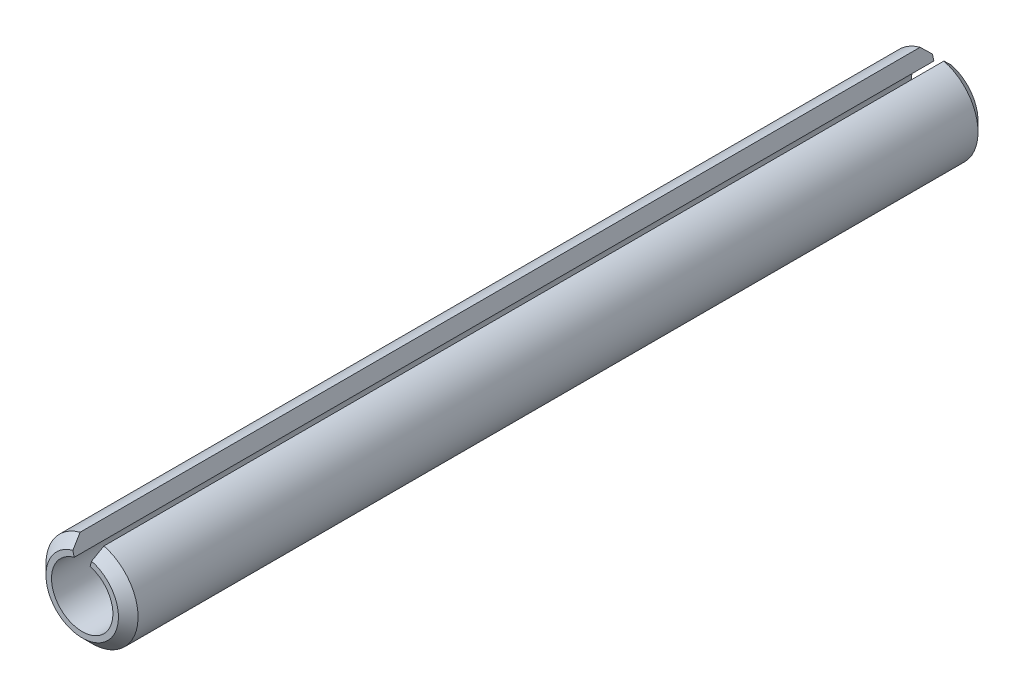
ISO-10303-21;
HEADER;
FILE_DESCRIPTION(('STEP AP214'),'2;1');
FILE_NAME('part.step','',(''),(''),'','','');
FILE_SCHEMA(('AUTOMOTIVE_DESIGN { 1 0 10303 214 1 1 1 1 }'));
ENDSEC;
DATA;
#1=APPLICATION_CONTEXT('core data for automotive mechanical design processes');
#2=APPLICATION_PROTOCOL_DEFINITION('international standard','automotive_design',2000,#1);
#3=PRODUCT_CONTEXT('',#1,'mechanical');
#4=PRODUCT('Part','Part','',(#3));
#5=PRODUCT_RELATED_PRODUCT_CATEGORY('part','',(#4));
#6=PRODUCT_DEFINITION_FORMATION('','',#4);
#7=PRODUCT_DEFINITION_CONTEXT('part definition',#1,'design');
#8=PRODUCT_DEFINITION('design','',#6,#7);
#9=PRODUCT_DEFINITION_SHAPE('','',#8);
#10=(LENGTH_UNIT() NAMED_UNIT(*) SI_UNIT(.MILLI.,.METRE.));
#11=(NAMED_UNIT(*) PLANE_ANGLE_UNIT() SI_UNIT($,.RADIAN.));
#12=(NAMED_UNIT(*) SI_UNIT($,.STERADIAN.) SOLID_ANGLE_UNIT());
#13=UNCERTAINTY_MEASURE_WITH_UNIT(LENGTH_MEASURE(1.E-05),#10,'distance_accuracy_value','');
#14=(GEOMETRIC_REPRESENTATION_CONTEXT(3) GLOBAL_UNCERTAINTY_ASSIGNED_CONTEXT((#13)) GLOBAL_UNIT_ASSIGNED_CONTEXT((#10,
#11,#12)) REPRESENTATION_CONTEXT('',''));
#15=CARTESIAN_POINT('',(0.,0.,0.));
#16=DIRECTION('',(0.,0.,1.));
#17=DIRECTION('',(1.,0.,0.));
#18=AXIS2_PLACEMENT_3D('',#15,#16,#17);
#19=CARTESIAN_POINT('',(0.,0.,11.1125));
#20=DIRECTION('',(0.,0.,-1.));
#21=DIRECTION('',(-1.,0.,0.));
#22=AXIS2_PLACEMENT_3D('',#19,#20,#21);
#23=CYLINDRICAL_SURFACE('',#22,0.79375);
#24=CARTESIAN_POINT('',(0.,0.,-11.1125));
#25=DIRECTION('',(0.,0.,-1.));
#26=DIRECTION('',(1.,0.,0.));
#27=AXIS2_PLACEMENT_3D('',#24,#25,#26);
#28=CIRCLE('',#27,0.79375);
#29=CARTESIAN_POINT('',(0.205437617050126,0.766703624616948,-11.1125));
#30=VERTEX_POINT('',#29);
#31=CARTESIAN_POINT('',(-0.205437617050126,0.766703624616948,-11.1125));
#32=VERTEX_POINT('',#31);
#33=EDGE_CURVE('E108',#30,#32,#28,.T.);
#34=ORIENTED_EDGE('',*,*,#33,.T.);
#35=DIRECTION('',(0.,0.,-1.));
#36=VECTOR('',#35,1.);
#37=CARTESIAN_POINT('',(-0.205437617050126,0.766703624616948,11.1125));
#38=LINE('',#37,#36);
#39=CARTESIAN_POINT('',(-0.205437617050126,0.766703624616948,11.1125));
#40=VERTEX_POINT('',#39);
#41=EDGE_CURVE('E92',#40,#32,#38,.T.);
#42=ORIENTED_EDGE('',*,*,#41,.F.);
#43=CARTESIAN_POINT('',(0.,0.,11.1125));
#44=DIRECTION('',(0.,0.,-1.));
#45=DIRECTION('',(1.,0.,0.));
#46=AXIS2_PLACEMENT_3D('',#43,#44,#45);
#47=CIRCLE('',#46,0.79375);
#48=CARTESIAN_POINT('',(0.205437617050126,0.766703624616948,11.1125));
#49=VERTEX_POINT('',#48);
#50=EDGE_CURVE('E97',#49,#40,#47,.T.);
#51=ORIENTED_EDGE('',*,*,#50,.F.);
#52=DIRECTION('',(0.,0.,-1.));
#53=VECTOR('',#52,1.);
#54=CARTESIAN_POINT('',(0.205437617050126,0.766703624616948,11.1125));
#55=LINE('',#54,#53);
#56=EDGE_CURVE('E143',#49,#30,#55,.T.);
#57=ORIENTED_EDGE('',*,*,#56,.T.);
#58=EDGE_LOOP('',(#34,#42,#51,#57));
#59=FACE_BOUND('',#58,.T.);
#60=ADVANCED_FACE('F35',(#59),#23,.F.);
#61=CARTESIAN_POINT('',(-0.205437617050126,0.766703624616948,11.1125));
#62=DIRECTION('',(-0.965925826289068,-0.258819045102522,0.));
#63=DIRECTION('',(0.258819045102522,-0.965925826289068,0.));
#64=AXIS2_PLACEMENT_3D('',#61,#62,#63);
#65=PLANE('',#64);
#66=DIRECTION('',(-0.258819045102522,0.965925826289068,0.));
#67=VECTOR('',#66,1.);
#68=CARTESIAN_POINT('',(-0.205437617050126,0.766703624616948,-11.1125));
#69=LINE('',#68,#67);
#70=CARTESIAN_POINT('',(-0.242416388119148,0.904710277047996,-11.1125));
#71=VERTEX_POINT('',#70);
#72=EDGE_CURVE('E127',#32,#71,#69,.T.);
#73=ORIENTED_EDGE('',*,*,#72,.T.);
#74=DIRECTION('',(0.183012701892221,-0.683012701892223,-0.707106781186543));
#75=VECTOR('',#74,1.);
#76=CARTESIAN_POINT('',(0.,0.,-12.049125));
#77=LINE('',#76,#75);
#78=CARTESIAN_POINT('',(-0.308156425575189,1.15005543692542,-10.8585));
#79=VERTEX_POINT('',#78);
#80=EDGE_CURVE('E43',#71,#79,#77,.F.);
#81=ORIENTED_EDGE('',*,*,#80,.T.);
#82=DIRECTION('',(0.,0.,-1.));
#83=VECTOR('',#82,1.);
#84=CARTESIAN_POINT('',(-0.30815642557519,1.15005543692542,11.1125));
#85=LINE('',#84,#83);
#86=CARTESIAN_POINT('',(-0.30815642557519,1.15005543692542,10.8585));
#87=VERTEX_POINT('',#86);
#88=EDGE_CURVE('E110',#87,#79,#85,.T.);
#89=ORIENTED_EDGE('',*,*,#88,.F.);
#90=DIRECTION('',(-0.18301270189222,0.683012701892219,-0.707106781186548));
#91=VECTOR('',#90,1.);
#92=CARTESIAN_POINT('',(0.,0.,12.049125));
#93=LINE('',#92,#91);
#94=CARTESIAN_POINT('',(-0.242416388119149,0.904710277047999,11.1125));
#95=VERTEX_POINT('',#94);
#96=EDGE_CURVE('E50',#87,#95,#93,.F.);
#97=ORIENTED_EDGE('',*,*,#96,.T.);
#98=DIRECTION('',(-0.258819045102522,0.965925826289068,0.));
#99=VECTOR('',#98,1.);
#100=CARTESIAN_POINT('',(-0.205437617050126,0.766703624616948,11.1125));
#101=LINE('',#100,#99);
#102=EDGE_CURVE('E88',#40,#95,#101,.T.);
#103=ORIENTED_EDGE('',*,*,#102,.F.);
#104=ORIENTED_EDGE('',*,*,#41,.T.);
#105=EDGE_LOOP('',(#73,#81,#89,#97,#103,#104));
#106=FACE_BOUND('',#105,.T.);
#107=ADVANCED_FACE('F90',(#106),#65,.F.);
#108=CARTESIAN_POINT('',(0.,0.,11.1125));
#109=DIRECTION('',(0.,0.,-1.));
#110=DIRECTION('',(-1.,0.,0.));
#111=AXIS2_PLACEMENT_3D('',#108,#109,#110);
#112=CYLINDRICAL_SURFACE('',#111,1.190625);
#113=ORIENTED_EDGE('',*,*,#88,.T.);
#114=CARTESIAN_POINT('',(0.,0.,-10.8585));
#115=DIRECTION('',(0.,0.,1.));
#116=DIRECTION('',(1.,0.,0.));
#117=AXIS2_PLACEMENT_3D('',#114,#115,#116);
#118=CIRCLE('',#117,1.190625);
#119=CARTESIAN_POINT('',(0.308156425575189,1.15005543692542,-10.8585));
#120=VERTEX_POINT('',#119);
#121=EDGE_CURVE('E112',#79,#120,#118,.T.);
#122=ORIENTED_EDGE('',*,*,#121,.T.);
#123=DIRECTION('',(0.,0.,-1.));
#124=VECTOR('',#123,1.);
#125=CARTESIAN_POINT('',(0.30815642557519,1.15005543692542,11.1125));
#126=LINE('',#125,#124);
#127=CARTESIAN_POINT('',(0.30815642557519,1.15005543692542,10.8585));
#128=VERTEX_POINT('',#127);
#129=EDGE_CURVE('E115',#128,#120,#126,.T.);
#130=ORIENTED_EDGE('',*,*,#129,.F.);
#131=CARTESIAN_POINT('',(0.,0.,10.8585));
#132=DIRECTION('',(0.,0.,1.));
#133=DIRECTION('',(1.,0.,0.));
#134=AXIS2_PLACEMENT_3D('',#131,#132,#133);
#135=CIRCLE('',#134,1.190625);
#136=EDGE_CURVE('E109',#128,#87,#135,.F.);
#137=ORIENTED_EDGE('',*,*,#136,.T.);
#138=EDGE_LOOP('',(#113,#122,#130,#137));
#139=FACE_BOUND('',#138,.T.);
#140=ADVANCED_FACE('F131',(#139),#112,.T.);
#141=CARTESIAN_POINT('',(0.205437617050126,0.766703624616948,11.1125));
#142=DIRECTION('',(0.965925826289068,-0.258819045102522,0.));
#143=DIRECTION('',(0.258819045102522,0.965925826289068,0.));
#144=AXIS2_PLACEMENT_3D('',#141,#142,#143);
#145=PLANE('',#144);
#146=ORIENTED_EDGE('',*,*,#129,.T.);
#147=DIRECTION('',(0.183012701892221,0.683012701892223,0.707106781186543));
#148=VECTOR('',#147,1.);
#149=CARTESIAN_POINT('',(0.,0.,-12.049125));
#150=LINE('',#149,#148);
#151=CARTESIAN_POINT('',(0.242416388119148,0.904710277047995,-11.1125));
#152=VERTEX_POINT('',#151);
#153=EDGE_CURVE('E123',#120,#152,#150,.F.);
#154=ORIENTED_EDGE('',*,*,#153,.T.);
#155=DIRECTION('',(-0.258819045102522,-0.965925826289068,0.));
#156=VECTOR('',#155,1.);
#157=CARTESIAN_POINT('',(0.205437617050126,0.766703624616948,-11.1125));
#158=LINE('',#157,#156);
#159=EDGE_CURVE('E105',#152,#30,#158,.T.);
#160=ORIENTED_EDGE('',*,*,#159,.T.);
#161=ORIENTED_EDGE('',*,*,#56,.F.);
#162=DIRECTION('',(-0.258819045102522,-0.965925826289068,0.));
#163=VECTOR('',#162,1.);
#164=CARTESIAN_POINT('',(0.205437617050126,0.766703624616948,11.1125));
#165=LINE('',#164,#163);
#166=CARTESIAN_POINT('',(0.242416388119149,0.904710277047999,11.1125));
#167=VERTEX_POINT('',#166);
#168=EDGE_CURVE('E96',#167,#49,#165,.T.);
#169=ORIENTED_EDGE('',*,*,#168,.F.);
#170=DIRECTION('',(-0.18301270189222,-0.683012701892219,0.707106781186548));
#171=VECTOR('',#170,1.);
#172=CARTESIAN_POINT('',(0.,0.,12.049125));
#173=LINE('',#172,#171);
#174=EDGE_CURVE('E121',#167,#128,#173,.F.);
#175=ORIENTED_EDGE('',*,*,#174,.T.);
#176=EDGE_LOOP('',(#146,#154,#160,#161,#169,#175));
#177=FACE_BOUND('',#176,.T.);
#178=ADVANCED_FACE('F137',(#177),#145,.F.);
#179=CARTESIAN_POINT('',(0.,0.,11.1125));
#180=DIRECTION('',(0.,0.,1.));
#181=DIRECTION('',(1.,0.,0.));
#182=AXIS2_PLACEMENT_3D('',#179,#180,#181);
#183=PLANE('',#182);
#184=ORIENTED_EDGE('',*,*,#102,.T.);
#185=CARTESIAN_POINT('',(0.,0.,11.1125));
#186=DIRECTION('',(0.,0.,1.));
#187=DIRECTION('',(1.,0.,0.));
#188=AXIS2_PLACEMENT_3D('',#185,#186,#187);
#189=CIRCLE('',#188,0.936625);
#190=EDGE_CURVE('E11',#95,#167,#189,.T.);
#191=ORIENTED_EDGE('',*,*,#190,.T.);
#192=ORIENTED_EDGE('',*,*,#168,.T.);
#193=ORIENTED_EDGE('',*,*,#50,.T.);
#194=EDGE_LOOP('',(#184,#191,#192,#193));
#195=FACE_BOUND('',#194,.T.);
#196=ADVANCED_FACE('F100',(#195),#183,.T.);
#197=CARTESIAN_POINT('',(0.,0.,-11.1125));
#198=DIRECTION('',(0.,0.,1.));
#199=DIRECTION('',(1.,0.,0.));
#200=AXIS2_PLACEMENT_3D('',#197,#198,#199);
#201=PLANE('',#200);
#202=ORIENTED_EDGE('',*,*,#159,.F.);
#203=CARTESIAN_POINT('',(0.,0.,-11.1125));
#204=DIRECTION('',(0.,0.,1.));
#205=DIRECTION('',(1.,0.,0.));
#206=AXIS2_PLACEMENT_3D('',#203,#204,#205);
#207=CIRCLE('',#206,0.936624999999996);
#208=EDGE_CURVE('E58',#152,#71,#207,.F.);
#209=ORIENTED_EDGE('',*,*,#208,.T.);
#210=ORIENTED_EDGE('',*,*,#72,.F.);
#211=ORIENTED_EDGE('',*,*,#33,.F.);
#212=EDGE_LOOP('',(#202,#209,#210,#211));
#213=FACE_BOUND('',#212,.T.);
#214=ADVANCED_FACE('F138',(#213),#201,.F.);
#215=CARTESIAN_POINT('',(0.,0.,-10.8585));
#216=DIRECTION('',(0.,0.,1.));
#217=DIRECTION('',(1.,0.,0.));
#218=AXIS2_PLACEMENT_3D('',#215,#216,#217);
#219=CONICAL_SURFACE('',#218,1.190625,0.785398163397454);
#220=ORIENTED_EDGE('',*,*,#80,.F.);
#221=ORIENTED_EDGE('',*,*,#208,.F.);
#222=ORIENTED_EDGE('',*,*,#153,.F.);
#223=ORIENTED_EDGE('',*,*,#121,.F.);
#224=EDGE_LOOP('',(#220,#221,#222,#223));
#225=FACE_BOUND('',#224,.T.);
#226=ADVANCED_FACE('F135',(#225),#219,.T.);
#227=CARTESIAN_POINT('',(0.,0.,11.1125));
#228=DIRECTION('',(0.,0.,-1.));
#229=DIRECTION('',(-1.,0.,0.));
#230=AXIS2_PLACEMENT_3D('',#227,#228,#229);
#231=CONICAL_SURFACE('',#230,0.936625,0.785398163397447);
#232=ORIENTED_EDGE('',*,*,#96,.F.);
#233=ORIENTED_EDGE('',*,*,#136,.F.);
#234=ORIENTED_EDGE('',*,*,#174,.F.);
#235=ORIENTED_EDGE('',*,*,#190,.F.);
#236=EDGE_LOOP('',(#232,#233,#234,#235));
#237=FACE_BOUND('',#236,.T.);
#238=ADVANCED_FACE('F37',(#237),#231,.T.);
#239=CLOSED_SHELL('',(#60,#107,#140,#178,#196,#214,#226,#238));
#240=MANIFOLD_SOLID_BREP('B2',#239);
#241=ADVANCED_BREP_SHAPE_REPRESENTATION('',(#18,#240),#14);
#242=SHAPE_DEFINITION_REPRESENTATION(#9,#241);
ENDSEC;
END-ISO-10303-21;
